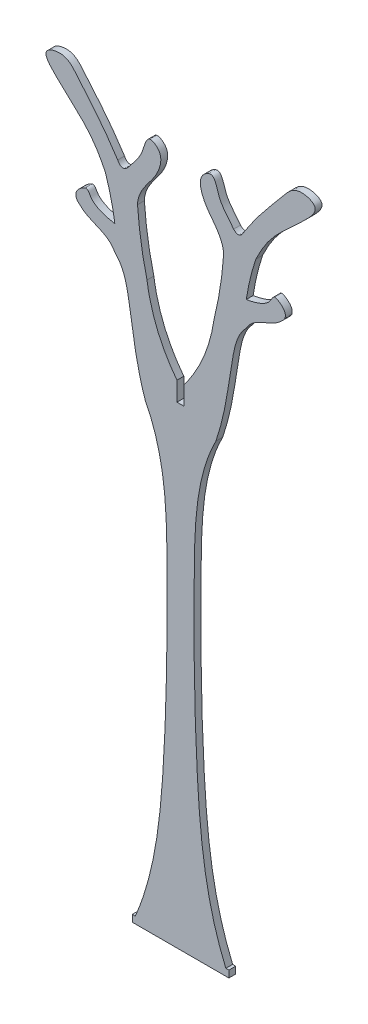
from build123d import *

# Parameters (mm, degrees)
ESTRUSIONE_ESTRUSIONE1_DEPTH = 18


with BuildPart() as part:
    # Schizzo2 → Estrusione-Estrusione1 (new body)
    with BuildSketch(Plane.XY):
        with BuildLine():
            Line((-1393.836762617, 755.407069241), (-1393.836762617, 705.407069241))
            Line((-1393.836762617, 705.407069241), (-1374.836762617, 705.407069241))
            Line((-1374.836762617, 705.407069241), (-1374.836762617, 755.407069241))
            add(Edge.make_bspline(
                [(-1374.836762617, 755.407069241), (-1311.591467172, 837.753798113), (-1296.054208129, 944.152143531)],
                knots=[0, 0, 0, 1, 1, 1], degree=2))
            add(Edge.make_bspline(
                [(-1271.13665379, 1103.184486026), (-1276.683197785, 1022.677221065), (-1296.054208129, 944.152143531)],
                knots=[0, 0, 0, 1, 1, 1], degree=2))
            add(Edge.make_bspline(
                [(-1271.13665379, 1103.184486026), (-1271.571303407, 1121.363237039), (-1286.990866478, 1153.211079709), (-1315.138968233, 1184.613009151), (-1327.753138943, 1211.02139287), (-1333.180158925, 1231.590212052), (-1332.426523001, 1255.598413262), (-1297.166248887, 1279.034747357), (-1282.12972549, 1215.36748143), (-1266.475051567, 1201.806170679), (-1244.796010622, 1173.854516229)],
                knots=[0, 0, 0, 0, 0.174589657, 0.335888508, 0.411381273, 0.458067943, 0.543973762, 0.636309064, 0.747697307, 1, 1, 1, 1], degree=3))
            add(Edge.make_bspline(
                [(-1218.99104069, 1178.927629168), (-1229.80070852, 1158.864840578), (-1244.796010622, 1173.854516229)],
                knots=[0, 0, 0, 1, 1, 1], degree=2))
            add(Edge.make_bspline(
                [(-1186.60667726, 1134.532205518), (-1149.400998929, 1212.771162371), (-1108.939817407, 1234.047444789), (-1011.357370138, 1334.96569604), (-1071.34135448, 1351.985725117), (-1098.80744979, 1334.517202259), (-1122.957951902, 1303.504840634), (-1166.239871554, 1255.022263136), (-1199.751693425, 1208.576722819), (-1218.99104069, 1178.927629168)],
                knots=[0, 0, 0, 0, 0.385763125, 0.485334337, 0.571206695, 0.624037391, 0.671733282, 0.795732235, 1, 1, 1, 1], degree=3))
            add(Edge.make_bspline(
                [(-1211.620069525, 1030.152460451), (-1203.784541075, 1083.420104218), (-1186.60667726, 1134.532205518)],
                knots=[0, 0, 0, 1, 1, 1], degree=2))
            add(Edge.make_bspline(
                [(-1118.990505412, 1027.718116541), (-1099.967157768, 1041.831066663), (-1112.812956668, 1063.218479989), (-1140.152327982, 1076.146777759), (-1147.616659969, 1057.698859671), (-1169.165283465, 1039.087505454), (-1194.519652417, 1033.084546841), (-1211.620069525, 1030.152460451)],
                knots=[0, 0, 0, 0, 0.336795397, 0.409108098, 0.521188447, 0.643455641, 1, 1, 1, 1], degree=3))
            add(Edge.make_bspline(
                [(-1118.990505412, 1027.718116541), (-1145.797680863, 999.806058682), (-1192.361682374, 1001.622757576), (-1211.620069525, 964.822679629)],
                knots=[0, 0, 0, 0, 1, 1, 1, 1], degree=3))
            add(Edge.make_bspline(
                [(-1291.467424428, 667.917231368), (-1278.803258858, 705.017011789), (-1262.09894115, 776.933907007), (-1249.154738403, 879.299557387), (-1234.266136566, 941.993846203), (-1211.620069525, 964.822679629)],
                knots=[0, 0, 0, 0, 0.379260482, 0.713287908, 1, 1, 1, 1], degree=3))
            add(Edge.make_bspline(
                [(-1291.467424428, 667.917231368), (-1345.814557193, 563.035618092), (-1350.5396556, 285.793308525), (-1347.891758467, -55.158589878), (-1323.809130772, -340.019747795), (-1287.45726613, -467.720308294), (-1265.378205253, -519.438172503)],
                knots=[0, 0, 0, 0, 0.287218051, 0.658216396, 0.847460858, 0.984083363, 0.984083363, 0.984083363, 0.984083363], degree=3))
            Line((-1265.378205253, -519.438172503), (-1257.379244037, -519.438172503))
            Line((-1257.379244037, -519.438172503), (-1257.379244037, -537.438172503))
            Line((-1257.379244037, -537.438172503), (-1511.294281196, -537.438172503))
            Line((-1511.294281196, -537.438172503), (-1511.294281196, -519.438172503))
            Line((-1511.294281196, -519.438172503), (-1503.29531998, -519.438172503))
            add(Edge.make_bspline(
                [(-1477.206100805, 667.917231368), (-1422.85896804, 563.035618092), (-1418.133869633, 285.793308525), (-1420.781766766, -55.158589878), (-1444.864394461, -340.019747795), (-1481.216259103, -467.720308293), (-1503.29531998, -519.438172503)],
                knots=[0, 0, 0, 0, 0.287218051, 0.658216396, 0.847460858, 0.984083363, 0.984083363, 0.984083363, 0.984083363], degree=3))
            add(Edge.make_bspline(
                [(-1477.206100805, 667.917231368), (-1489.870266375, 705.017011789), (-1506.574584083, 776.933907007), (-1519.51878683, 879.299557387), (-1534.407388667, 941.993846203), (-1557.053455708, 964.822679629)],
                knots=[0, 0, 0, 0, 0.379260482, 0.713287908, 1, 1, 1, 1], degree=3))
            add(Edge.make_bspline(
                [(-1649.683019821, 1027.718116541), (-1622.87584437, 999.806058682), (-1576.311842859, 1001.622757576), (-1557.053455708, 964.822679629)],
                knots=[0, 0, 0, 0, 1, 1, 1, 1], degree=3))
            add(Edge.make_bspline(
                [(-1649.683019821, 1027.718116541), (-1668.706367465, 1041.831066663), (-1655.860568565, 1063.218479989), (-1628.521197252, 1076.146777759), (-1621.056865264, 1057.698859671), (-1599.508241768, 1039.087505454), (-1574.153872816, 1033.084546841), (-1557.053455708, 1030.152460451)],
                knots=[0, 0, 0, 0, 0.336795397, 0.409108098, 0.521188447, 0.643455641, 1, 1, 1, 1], degree=3))
            add(Edge.make_bspline(
                [(-1557.053455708, 1030.152460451), (-1564.888984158, 1083.420104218), (-1582.066847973, 1134.532205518)],
                knots=[0, 0, 0, 1, 1, 1], degree=2))
            add(Edge.make_bspline(
                [(-1582.066847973, 1134.532205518), (-1619.272526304, 1212.771162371), (-1659.733707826, 1234.047444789), (-1757.316155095, 1334.96569604), (-1697.332170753, 1351.985725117), (-1669.866075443, 1334.517202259), (-1645.715573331, 1303.504840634), (-1602.433653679, 1255.022263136), (-1568.921831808, 1208.576722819), (-1549.682484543, 1178.927629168)],
                knots=[0, 0, 0, 0, 0.385763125, 0.485334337, 0.571206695, 0.624037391, 0.671733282, 0.795732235, 1, 1, 1, 1], degree=3))
            add(Edge.make_bspline(
                [(-1549.682484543, 1178.927629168), (-1538.872816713, 1158.864840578), (-1523.877514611, 1173.854516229)],
                knots=[0, 0, 0, 1, 1, 1], degree=2))
            add(Edge.make_bspline(
                [(-1497.536871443, 1103.184486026), (-1497.102221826, 1121.363237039), (-1481.682658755, 1153.211079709), (-1453.534557, 1184.613009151), (-1440.92038629, 1211.02139287), (-1435.493366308, 1231.590212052), (-1436.247002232, 1255.598413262), (-1471.507276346, 1279.034747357), (-1486.543799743, 1215.36748143), (-1502.198473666, 1201.806170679), (-1523.877514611, 1173.854516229)],
                knots=[0, 0, 0, 0, 0.174589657, 0.335888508, 0.411381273, 0.458067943, 0.543973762, 0.636309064, 0.747697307, 1, 1, 1, 1], degree=3))
            add(Edge.make_bspline(
                [(-1497.536871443, 1103.184486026), (-1491.990327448, 1022.677221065), (-1472.619317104, 944.152143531)],
                knots=[0, 0, 0, 1, 1, 1], degree=2))
            add(Edge.make_bspline(
                [(-1393.836762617, 755.407069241), (-1457.082058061, 837.753798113), (-1472.619317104, 944.152143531)],
                knots=[0, 0, 0, 1, 1, 1], degree=2))
        make_face()
    extrude(amount=ESTRUSIONE_ESTRUSIONE1_DEPTH)


solid = part.part
